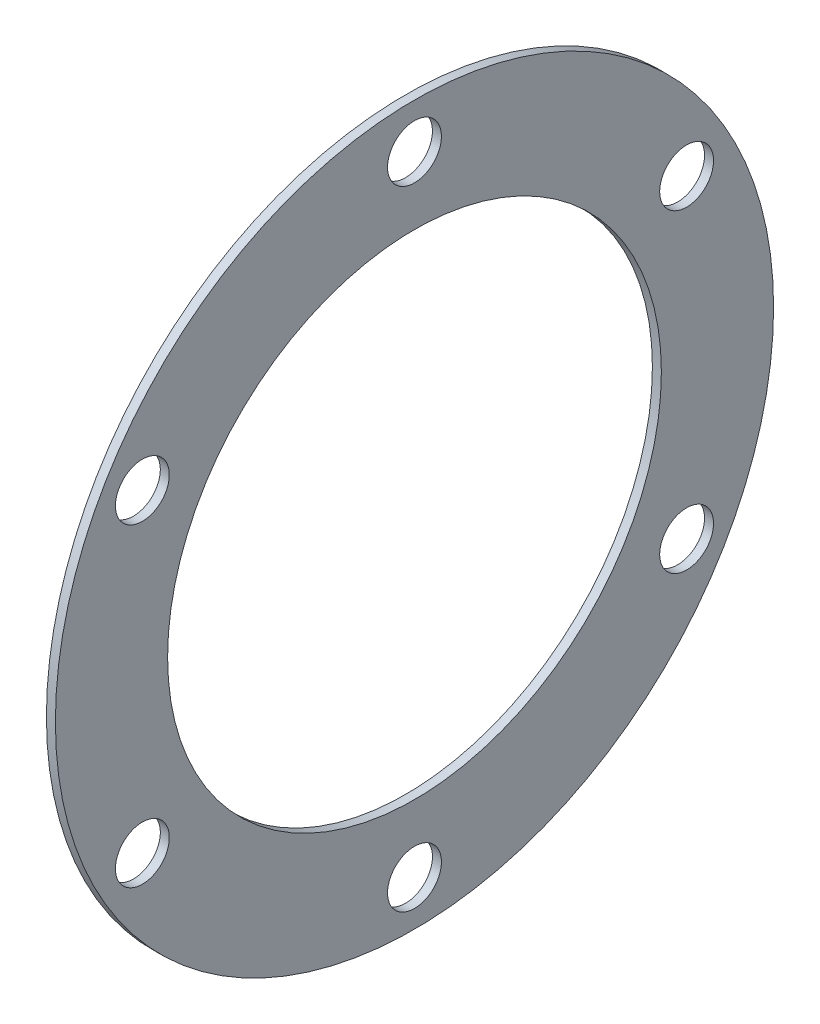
ISO-10303-21;
HEADER;
FILE_DESCRIPTION(('STEP AP214'),'2;1');
FILE_NAME('part.step','',(''),(''),'','','');
FILE_SCHEMA(('AUTOMOTIVE_DESIGN { 1 0 10303 214 1 1 1 1 }'));
ENDSEC;
DATA;
#1=APPLICATION_CONTEXT('core data for automotive mechanical design processes');
#2=APPLICATION_PROTOCOL_DEFINITION('international standard','automotive_design',2000,#1);
#3=PRODUCT_CONTEXT('',#1,'mechanical');
#4=PRODUCT('Part','Part','',(#3));
#5=PRODUCT_RELATED_PRODUCT_CATEGORY('part','',(#4));
#6=PRODUCT_DEFINITION_FORMATION('','',#4);
#7=PRODUCT_DEFINITION_CONTEXT('part definition',#1,'design');
#8=PRODUCT_DEFINITION('design','',#6,#7);
#9=PRODUCT_DEFINITION_SHAPE('','',#8);
#10=(LENGTH_UNIT() NAMED_UNIT(*) SI_UNIT(.MILLI.,.METRE.));
#11=(NAMED_UNIT(*) PLANE_ANGLE_UNIT() SI_UNIT($,.RADIAN.));
#12=(NAMED_UNIT(*) SI_UNIT($,.STERADIAN.) SOLID_ANGLE_UNIT());
#13=UNCERTAINTY_MEASURE_WITH_UNIT(LENGTH_MEASURE(1.E-05),#10,'distance_accuracy_value','');
#14=(GEOMETRIC_REPRESENTATION_CONTEXT(3) GLOBAL_UNCERTAINTY_ASSIGNED_CONTEXT((#13)) GLOBAL_UNIT_ASSIGNED_CONTEXT((#10,
#11,#12)) REPRESENTATION_CONTEXT('',''));
#15=CARTESIAN_POINT('',(0.,0.,0.));
#16=DIRECTION('',(0.,0.,1.));
#17=DIRECTION('',(1.,0.,0.));
#18=AXIS2_PLACEMENT_3D('',#15,#16,#17);
#19=CARTESIAN_POINT('',(2.,-22.3862604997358,0.));
#20=DIRECTION('',(-1.,0.,0.));
#21=DIRECTION('',(0.,0.,1.));
#22=AXIS2_PLACEMENT_3D('',#19,#20,#21);
#23=PLANE('',#22);
#24=CARTESIAN_POINT('',(2.,35.0000000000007,60.6217782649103));
#25=DIRECTION('',(-1.,0.,0.));
#26=DIRECTION('',(0.,0.,1.));
#27=AXIS2_PLACEMENT_3D('',#24,#25,#26);
#28=CIRCLE('',#27,6.);
#29=CARTESIAN_POINT('',(2.,35.0000000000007,66.6217782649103));
#30=VERTEX_POINT('',#29);
#31=EDGE_CURVE('E79',#30,#30,#28,.F.);
#32=ORIENTED_EDGE('',*,*,#31,.F.);
#33=EDGE_LOOP('',(#32));
#34=FACE_BOUND('',#33,.T.);
#35=CARTESIAN_POINT('',(2.,-34.9999999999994,60.621778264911));
#36=DIRECTION('',(-1.,0.,0.));
#37=DIRECTION('',(0.,0.,1.));
#38=AXIS2_PLACEMENT_3D('',#35,#36,#37);
#39=CIRCLE('',#38,6.);
#40=CARTESIAN_POINT('',(2.,-34.9999999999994,66.621778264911));
#41=VERTEX_POINT('',#40);
#42=EDGE_CURVE('E73',#41,#41,#39,.F.);
#43=ORIENTED_EDGE('',*,*,#42,.F.);
#44=EDGE_LOOP('',(#43));
#45=FACE_BOUND('',#44,.T.);
#46=CARTESIAN_POINT('',(2.,-70.,4.88807670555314E-13));
#47=DIRECTION('',(-1.,0.,0.));
#48=DIRECTION('',(0.,0.,1.));
#49=AXIS2_PLACEMENT_3D('',#46,#47,#48);
#50=CIRCLE('',#49,6.);
#51=CARTESIAN_POINT('',(2.,-70.,6.00000000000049));
#52=VERTEX_POINT('',#51);
#53=EDGE_CURVE('E67',#52,#52,#50,.F.);
#54=ORIENTED_EDGE('',*,*,#53,.F.);
#55=EDGE_LOOP('',(#54));
#56=FACE_BOUND('',#55,.T.);
#57=CARTESIAN_POINT('',(2.,-35.0000000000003,-60.6217782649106));
#58=DIRECTION('',(-1.,0.,0.));
#59=DIRECTION('',(0.,0.,1.));
#60=AXIS2_PLACEMENT_3D('',#57,#58,#59);
#61=CIRCLE('',#60,6.);
#62=CARTESIAN_POINT('',(2.,-35.0000000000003,-54.6217782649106));
#63=VERTEX_POINT('',#62);
#64=EDGE_CURVE('E61',#63,#63,#61,.F.);
#65=ORIENTED_EDGE('',*,*,#64,.F.);
#66=EDGE_LOOP('',(#65));
#67=FACE_BOUND('',#66,.T.);
#68=CARTESIAN_POINT('',(2.,34.9999999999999,-60.6217782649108));
#69=DIRECTION('',(-1.,0.,0.));
#70=DIRECTION('',(0.,0.,1.));
#71=AXIS2_PLACEMENT_3D('',#68,#69,#70);
#72=CIRCLE('',#71,6.);
#73=CARTESIAN_POINT('',(2.,34.9999999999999,-54.6217782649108));
#74=VERTEX_POINT('',#73);
#75=EDGE_CURVE('E55',#74,#74,#72,.F.);
#76=ORIENTED_EDGE('',*,*,#75,.F.);
#77=EDGE_LOOP('',(#76));
#78=FACE_BOUND('',#77,.T.);
#79=CARTESIAN_POINT('',(2.,0.,0.));
#80=DIRECTION('',(-1.,0.,0.));
#81=DIRECTION('',(0.,0.,1.));
#82=AXIS2_PLACEMENT_3D('',#79,#80,#81);
#83=CIRCLE('',#82,55.);
#84=CARTESIAN_POINT('',(2.,0.,55.));
#85=VERTEX_POINT('',#84);
#86=EDGE_CURVE('E49',#85,#85,#83,.F.);
#87=ORIENTED_EDGE('',*,*,#86,.F.);
#88=EDGE_LOOP('',(#87));
#89=FACE_BOUND('',#88,.T.);
#90=CARTESIAN_POINT('',(2.,70.,0.));
#91=DIRECTION('',(-1.,0.,0.));
#92=DIRECTION('',(0.,0.,1.));
#93=AXIS2_PLACEMENT_3D('',#90,#91,#92);
#94=CIRCLE('',#93,6.);
#95=CARTESIAN_POINT('',(2.,70.,6.));
#96=VERTEX_POINT('',#95);
#97=EDGE_CURVE('E40',#96,#96,#94,.F.);
#98=ORIENTED_EDGE('',*,*,#97,.F.);
#99=EDGE_LOOP('',(#98));
#100=FACE_BOUND('',#99,.T.);
#101=CARTESIAN_POINT('',(2.,0.,0.));
#102=DIRECTION('',(1.,0.,0.));
#103=DIRECTION('',(0.,0.,-1.));
#104=AXIS2_PLACEMENT_3D('',#101,#102,#103);
#105=CIRCLE('',#104,80.);
#106=CARTESIAN_POINT('',(2.,0.,-80.));
#107=VERTEX_POINT('',#106);
#108=EDGE_CURVE('E10',#107,#107,#105,.T.);
#109=ORIENTED_EDGE('',*,*,#108,.T.);
#110=EDGE_LOOP('',(#109));
#111=FACE_BOUND('',#110,.T.);
#112=ADVANCED_FACE('F30',(#34,#45,#56,#67,#78,#89,#100,#111),#23,.F.);
#113=CARTESIAN_POINT('',(29.9069920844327,0.,0.));
#114=DIRECTION('',(1.,0.,0.));
#115=DIRECTION('',(0.,0.,-1.));
#116=AXIS2_PLACEMENT_3D('',#113,#114,#115);
#117=CYLINDRICAL_SURFACE('',#116,80.);
#118=ORIENTED_EDGE('',*,*,#108,.F.);
#119=EDGE_LOOP('',(#118));
#120=FACE_BOUND('',#119,.T.);
#121=CARTESIAN_POINT('',(0.,0.,0.));
#122=DIRECTION('',(1.,0.,0.));
#123=DIRECTION('',(0.,0.,-1.));
#124=AXIS2_PLACEMENT_3D('',#121,#122,#123);
#125=CIRCLE('',#124,80.);
#126=CARTESIAN_POINT('',(0.,0.,-80.));
#127=VERTEX_POINT('',#126);
#128=EDGE_CURVE('E36',#127,#127,#125,.T.);
#129=ORIENTED_EDGE('',*,*,#128,.T.);
#130=EDGE_LOOP('',(#129));
#131=FACE_BOUND('',#130,.T.);
#132=ADVANCED_FACE('F93',(#120,#131),#117,.T.);
#133=CARTESIAN_POINT('',(0.,-22.3862604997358,0.));
#134=DIRECTION('',(1.,0.,0.));
#135=DIRECTION('',(0.,0.,-1.));
#136=AXIS2_PLACEMENT_3D('',#133,#134,#135);
#137=PLANE('',#136);
#138=CARTESIAN_POINT('',(0.,35.0000000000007,60.6217782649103));
#139=DIRECTION('',(-1.,0.,0.));
#140=DIRECTION('',(0.,-0.866025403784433,0.50000000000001));
#141=AXIS2_PLACEMENT_3D('',#138,#139,#140);
#142=CIRCLE('',#141,6.);
#143=CARTESIAN_POINT('',(0.,29.8038475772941,63.6217782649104));
#144=VERTEX_POINT('',#143);
#145=EDGE_CURVE('E82',#144,#144,#142,.T.);
#146=ORIENTED_EDGE('',*,*,#145,.F.);
#147=EDGE_LOOP('',(#146));
#148=FACE_BOUND('',#147,.T.);
#149=CARTESIAN_POINT('',(0.,-34.9999999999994,60.621778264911));
#150=DIRECTION('',(-1.,0.,0.));
#151=DIRECTION('',(0.,-0.866025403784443,-0.499999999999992));
#152=AXIS2_PLACEMENT_3D('',#149,#150,#151);
#153=CIRCLE('',#152,6.);
#154=CARTESIAN_POINT('',(0.,-40.1961524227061,57.6217782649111));
#155=VERTEX_POINT('',#154);
#156=EDGE_CURVE('E76',#155,#155,#153,.T.);
#157=ORIENTED_EDGE('',*,*,#156,.F.);
#158=EDGE_LOOP('',(#157));
#159=FACE_BOUND('',#158,.T.);
#160=CARTESIAN_POINT('',(0.,-70.,4.88807670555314E-13));
#161=DIRECTION('',(-1.,0.,0.));
#162=DIRECTION('',(0.,0.,-1.));
#163=AXIS2_PLACEMENT_3D('',#160,#161,#162);
#164=CIRCLE('',#163,6.);
#165=CARTESIAN_POINT('',(0.,-70.,-5.99999999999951));
#166=VERTEX_POINT('',#165);
#167=EDGE_CURVE('E70',#166,#166,#164,.T.);
#168=ORIENTED_EDGE('',*,*,#167,.F.);
#169=EDGE_LOOP('',(#168));
#170=FACE_BOUND('',#169,.T.);
#171=CARTESIAN_POINT('',(0.,-35.0000000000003,-60.6217782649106));
#172=DIRECTION('',(-1.,0.,0.));
#173=DIRECTION('',(0.,0.866025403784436,-0.500000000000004));
#174=AXIS2_PLACEMENT_3D('',#171,#172,#173);
#175=CIRCLE('',#174,6.);
#176=CARTESIAN_POINT('',(0.,-29.8038475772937,-63.6217782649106));
#177=VERTEX_POINT('',#176);
#178=EDGE_CURVE('E64',#177,#177,#175,.T.);
#179=ORIENTED_EDGE('',*,*,#178,.F.);
#180=EDGE_LOOP('',(#179));
#181=FACE_BOUND('',#180,.T.);
#182=CARTESIAN_POINT('',(0.,34.9999999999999,-60.6217782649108));
#183=DIRECTION('',(-1.,0.,0.));
#184=DIRECTION('',(0.,0.86602540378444,0.499999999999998));
#185=AXIS2_PLACEMENT_3D('',#182,#183,#184);
#186=CIRCLE('',#185,6.);
#187=CARTESIAN_POINT('',(0.,40.1961524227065,-57.6217782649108));
#188=VERTEX_POINT('',#187);
#189=EDGE_CURVE('E58',#188,#188,#186,.T.);
#190=ORIENTED_EDGE('',*,*,#189,.F.);
#191=EDGE_LOOP('',(#190));
#192=FACE_BOUND('',#191,.T.);
#193=CARTESIAN_POINT('',(0.,0.,0.));
#194=DIRECTION('',(-1.,0.,0.));
#195=DIRECTION('',(0.,0.,1.));
#196=AXIS2_PLACEMENT_3D('',#193,#194,#195);
#197=CIRCLE('',#196,55.);
#198=CARTESIAN_POINT('',(0.,0.,55.));
#199=VERTEX_POINT('',#198);
#200=EDGE_CURVE('E52',#199,#199,#197,.T.);
#201=ORIENTED_EDGE('',*,*,#200,.F.);
#202=EDGE_LOOP('',(#201));
#203=FACE_BOUND('',#202,.T.);
#204=CARTESIAN_POINT('',(0.,70.,0.));
#205=DIRECTION('',(-1.,0.,0.));
#206=DIRECTION('',(0.,0.,1.));
#207=AXIS2_PLACEMENT_3D('',#204,#205,#206);
#208=CIRCLE('',#207,6.);
#209=CARTESIAN_POINT('',(0.,70.,6.));
#210=VERTEX_POINT('',#209);
#211=EDGE_CURVE('E44',#210,#210,#208,.T.);
#212=ORIENTED_EDGE('',*,*,#211,.F.);
#213=EDGE_LOOP('',(#212));
#214=FACE_BOUND('',#213,.T.);
#215=ORIENTED_EDGE('',*,*,#128,.F.);
#216=EDGE_LOOP('',(#215));
#217=FACE_BOUND('',#216,.T.);
#218=ADVANCED_FACE('F89',(#148,#159,#170,#181,#192,#203,#214,#217),#137,.F.);
#219=CARTESIAN_POINT('',(2.001,70.,0.));
#220=DIRECTION('',(-1.,0.,0.));
#221=DIRECTION('',(0.,0.,1.));
#222=AXIS2_PLACEMENT_3D('',#219,#220,#221);
#223=CYLINDRICAL_SURFACE('',#222,6.);
#224=ORIENTED_EDGE('',*,*,#211,.T.);
#225=EDGE_LOOP('',(#224));
#226=FACE_BOUND('',#225,.T.);
#227=ORIENTED_EDGE('',*,*,#97,.T.);
#228=EDGE_LOOP('',(#227));
#229=FACE_BOUND('',#228,.T.);
#230=ADVANCED_FACE('F92',(#226,#229),#223,.F.);
#231=CARTESIAN_POINT('',(2.001,0.,0.));
#232=DIRECTION('',(-1.,0.,0.));
#233=DIRECTION('',(0.,0.,1.));
#234=AXIS2_PLACEMENT_3D('',#231,#232,#233);
#235=CYLINDRICAL_SURFACE('',#234,55.);
#236=ORIENTED_EDGE('',*,*,#200,.T.);
#237=EDGE_LOOP('',(#236));
#238=FACE_BOUND('',#237,.T.);
#239=ORIENTED_EDGE('',*,*,#86,.T.);
#240=EDGE_LOOP('',(#239));
#241=FACE_BOUND('',#240,.T.);
#242=ADVANCED_FACE('F110',(#238,#241),#235,.F.);
#243=CARTESIAN_POINT('',(2.001,34.9999999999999,-60.6217782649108));
#244=DIRECTION('',(-1.,0.,0.));
#245=DIRECTION('',(0.,0.,1.));
#246=AXIS2_PLACEMENT_3D('',#243,#244,#245);
#247=CYLINDRICAL_SURFACE('',#246,6.);
#248=ORIENTED_EDGE('',*,*,#189,.T.);
#249=EDGE_LOOP('',(#248));
#250=FACE_BOUND('',#249,.T.);
#251=ORIENTED_EDGE('',*,*,#75,.T.);
#252=EDGE_LOOP('',(#251));
#253=FACE_BOUND('',#252,.T.);
#254=ADVANCED_FACE('F133',(#250,#253),#247,.F.);
#255=CARTESIAN_POINT('',(2.001,-35.0000000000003,-60.6217782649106));
#256=DIRECTION('',(-1.,0.,0.));
#257=DIRECTION('',(0.,0.,1.));
#258=AXIS2_PLACEMENT_3D('',#255,#256,#257);
#259=CYLINDRICAL_SURFACE('',#258,6.);
#260=ORIENTED_EDGE('',*,*,#178,.T.);
#261=EDGE_LOOP('',(#260));
#262=FACE_BOUND('',#261,.T.);
#263=ORIENTED_EDGE('',*,*,#64,.T.);
#264=EDGE_LOOP('',(#263));
#265=FACE_BOUND('',#264,.T.);
#266=ADVANCED_FACE('F139',(#262,#265),#259,.F.);
#267=CARTESIAN_POINT('',(2.001,-70.,4.88807670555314E-13));
#268=DIRECTION('',(-1.,0.,0.));
#269=DIRECTION('',(0.,0.,1.));
#270=AXIS2_PLACEMENT_3D('',#267,#268,#269);
#271=CYLINDRICAL_SURFACE('',#270,6.);
#272=ORIENTED_EDGE('',*,*,#167,.T.);
#273=EDGE_LOOP('',(#272));
#274=FACE_BOUND('',#273,.T.);
#275=ORIENTED_EDGE('',*,*,#53,.T.);
#276=EDGE_LOOP('',(#275));
#277=FACE_BOUND('',#276,.T.);
#278=ADVANCED_FACE('F145',(#274,#277),#271,.F.);
#279=CARTESIAN_POINT('',(2.001,-34.9999999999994,60.621778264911));
#280=DIRECTION('',(-1.,0.,0.));
#281=DIRECTION('',(0.,0.,1.));
#282=AXIS2_PLACEMENT_3D('',#279,#280,#281);
#283=CYLINDRICAL_SURFACE('',#282,6.);
#284=ORIENTED_EDGE('',*,*,#156,.T.);
#285=EDGE_LOOP('',(#284));
#286=FACE_BOUND('',#285,.T.);
#287=ORIENTED_EDGE('',*,*,#42,.T.);
#288=EDGE_LOOP('',(#287));
#289=FACE_BOUND('',#288,.T.);
#290=ADVANCED_FACE('F149',(#286,#289),#283,.F.);
#291=CARTESIAN_POINT('',(2.001,35.0000000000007,60.6217782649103));
#292=DIRECTION('',(-1.,0.,0.));
#293=DIRECTION('',(0.,0.,1.));
#294=AXIS2_PLACEMENT_3D('',#291,#292,#293);
#295=CYLINDRICAL_SURFACE('',#294,6.);
#296=ORIENTED_EDGE('',*,*,#145,.T.);
#297=EDGE_LOOP('',(#296));
#298=FACE_BOUND('',#297,.T.);
#299=ORIENTED_EDGE('',*,*,#31,.T.);
#300=EDGE_LOOP('',(#299));
#301=FACE_BOUND('',#300,.T.);
#302=ADVANCED_FACE('F86',(#298,#301),#295,.F.);
#303=CLOSED_SHELL('',(#112,#132,#218,#230,#242,#254,#266,#278,#290,#302));
#304=MANIFOLD_SOLID_BREP('B2',#303);
#305=ADVANCED_BREP_SHAPE_REPRESENTATION('',(#18,#304),#14);
#306=SHAPE_DEFINITION_REPRESENTATION(#9,#305);
ENDSEC;
END-ISO-10303-21;
